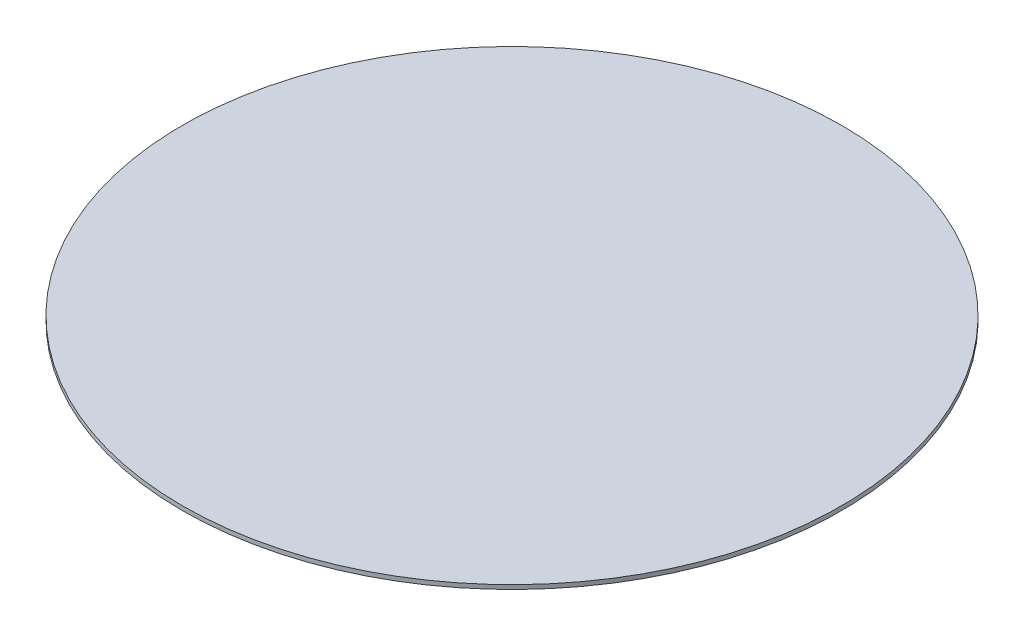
ISO-10303-21;
HEADER;
FILE_DESCRIPTION(('STEP AP214'),'2;1');
FILE_NAME('part.step','',(''),(''),'','','');
FILE_SCHEMA(('AUTOMOTIVE_DESIGN { 1 0 10303 214 1 1 1 1 }'));
ENDSEC;
DATA;
#1=APPLICATION_CONTEXT('core data for automotive mechanical design processes');
#2=APPLICATION_PROTOCOL_DEFINITION('international standard','automotive_design',2000,#1);
#3=PRODUCT_CONTEXT('',#1,'mechanical');
#4=PRODUCT('Part','Part','',(#3));
#5=PRODUCT_RELATED_PRODUCT_CATEGORY('part','',(#4));
#6=PRODUCT_DEFINITION_FORMATION('','',#4);
#7=PRODUCT_DEFINITION_CONTEXT('part definition',#1,'design');
#8=PRODUCT_DEFINITION('design','',#6,#7);
#9=PRODUCT_DEFINITION_SHAPE('','',#8);
#10=(LENGTH_UNIT() NAMED_UNIT(*) SI_UNIT(.MILLI.,.METRE.));
#11=(NAMED_UNIT(*) PLANE_ANGLE_UNIT() SI_UNIT($,.RADIAN.));
#12=(NAMED_UNIT(*) SI_UNIT($,.STERADIAN.) SOLID_ANGLE_UNIT());
#13=UNCERTAINTY_MEASURE_WITH_UNIT(LENGTH_MEASURE(1.E-05),#10,'distance_accuracy_value','');
#14=(GEOMETRIC_REPRESENTATION_CONTEXT(3) GLOBAL_UNCERTAINTY_ASSIGNED_CONTEXT((#13)) GLOBAL_UNIT_ASSIGNED_CONTEXT((#10,
#11,#12)) REPRESENTATION_CONTEXT('',''));
#15=CARTESIAN_POINT('',(0.,0.,0.));
#16=DIRECTION('',(0.,0.,1.));
#17=DIRECTION('',(1.,0.,0.));
#18=AXIS2_PLACEMENT_3D('',#15,#16,#17);
#19=CARTESIAN_POINT('',(0.,0.3,0.));
#20=DIRECTION('',(0.,-1.,0.));
#21=DIRECTION('',(0.,0.,-1.));
#22=AXIS2_PLACEMENT_3D('',#19,#20,#21);
#23=CYLINDRICAL_SURFACE('',#22,23.5);
#24=CARTESIAN_POINT('',(0.,0.3,0.));
#25=DIRECTION('',(0.,1.,0.));
#26=DIRECTION('',(0.,0.,1.));
#27=AXIS2_PLACEMENT_3D('',#24,#25,#26);
#28=CIRCLE('',#27,23.5);
#29=CARTESIAN_POINT('',(0.,0.3,23.5));
#30=VERTEX_POINT('',#29);
#31=EDGE_CURVE('E10',#30,#30,#28,.T.);
#32=ORIENTED_EDGE('',*,*,#31,.F.);
#33=EDGE_LOOP('',(#32));
#34=FACE_BOUND('',#33,.T.);
#35=CARTESIAN_POINT('',(0.,0.,0.));
#36=DIRECTION('',(0.,1.,0.));
#37=DIRECTION('',(0.,0.,1.));
#38=AXIS2_PLACEMENT_3D('',#35,#36,#37);
#39=CIRCLE('',#38,23.5);
#40=CARTESIAN_POINT('',(0.,0.,23.5));
#41=VERTEX_POINT('',#40);
#42=EDGE_CURVE('E38',#41,#41,#39,.T.);
#43=ORIENTED_EDGE('',*,*,#42,.T.);
#44=EDGE_LOOP('',(#43));
#45=FACE_BOUND('',#44,.T.);
#46=ADVANCED_FACE('F35',(#34,#45),#23,.T.);
#47=CARTESIAN_POINT('',(0.,0.3,0.));
#48=DIRECTION('',(0.,1.,0.));
#49=DIRECTION('',(0.,0.,1.));
#50=AXIS2_PLACEMENT_3D('',#47,#48,#49);
#51=PLANE('',#50);
#52=ORIENTED_EDGE('',*,*,#31,.T.);
#53=EDGE_LOOP('',(#52));
#54=FACE_BOUND('',#53,.T.);
#55=ADVANCED_FACE('F50',(#54),#51,.T.);
#56=CARTESIAN_POINT('',(0.,0.,0.));
#57=DIRECTION('',(0.,1.,0.));
#58=DIRECTION('',(0.,0.,1.));
#59=AXIS2_PLACEMENT_3D('',#56,#57,#58);
#60=PLANE('',#59);
#61=ORIENTED_EDGE('',*,*,#42,.F.);
#62=EDGE_LOOP('',(#61));
#63=FACE_BOUND('',#62,.T.);
#64=ADVANCED_FACE('F48',(#63),#60,.F.);
#65=CLOSED_SHELL('',(#46,#55,#64));
#66=MANIFOLD_SOLID_BREP('B2',#65);
#67=ADVANCED_BREP_SHAPE_REPRESENTATION('',(#18,#66),#14);
#68=SHAPE_DEFINITION_REPRESENTATION(#9,#67);
ENDSEC;
END-ISO-10303-21;
